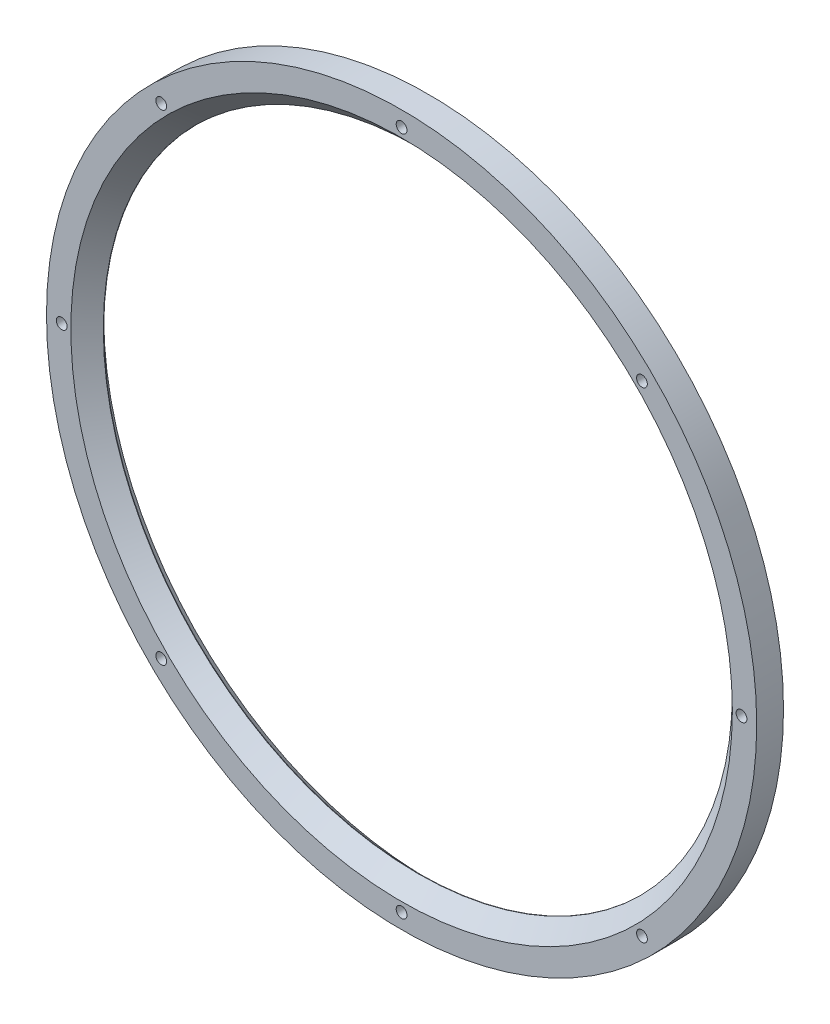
ISO-10303-21;
HEADER;
FILE_DESCRIPTION(('STEP AP214'),'2;1');
FILE_NAME('part.step','',(''),(''),'','','');
FILE_SCHEMA(('AUTOMOTIVE_DESIGN { 1 0 10303 214 1 1 1 1 }'));
ENDSEC;
DATA;
#1=APPLICATION_CONTEXT('core data for automotive mechanical design processes');
#2=APPLICATION_PROTOCOL_DEFINITION('international standard','automotive_design',2000,#1);
#3=PRODUCT_CONTEXT('',#1,'mechanical');
#4=PRODUCT('Part','Part','',(#3));
#5=PRODUCT_RELATED_PRODUCT_CATEGORY('part','',(#4));
#6=PRODUCT_DEFINITION_FORMATION('','',#4);
#7=PRODUCT_DEFINITION_CONTEXT('part definition',#1,'design');
#8=PRODUCT_DEFINITION('design','',#6,#7);
#9=PRODUCT_DEFINITION_SHAPE('','',#8);
#10=(LENGTH_UNIT() NAMED_UNIT(*) SI_UNIT(.MILLI.,.METRE.));
#11=(NAMED_UNIT(*) PLANE_ANGLE_UNIT() SI_UNIT($,.RADIAN.));
#12=(NAMED_UNIT(*) SI_UNIT($,.STERADIAN.) SOLID_ANGLE_UNIT());
#13=UNCERTAINTY_MEASURE_WITH_UNIT(LENGTH_MEASURE(1.E-05),#10,'distance_accuracy_value','');
#14=(GEOMETRIC_REPRESENTATION_CONTEXT(3) GLOBAL_UNCERTAINTY_ASSIGNED_CONTEXT((#13)) GLOBAL_UNIT_ASSIGNED_CONTEXT((#10,
#11,#12)) REPRESENTATION_CONTEXT('',''));
#15=CARTESIAN_POINT('',(0.,0.,0.));
#16=DIRECTION('',(0.,0.,1.));
#17=DIRECTION('',(1.,0.,0.));
#18=AXIS2_PLACEMENT_3D('',#15,#16,#17);
#19=CARTESIAN_POINT('',(0.,0.,-10.1600000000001));
#20=DIRECTION('',(0.,0.,1.));
#21=DIRECTION('',(1.,0.,0.));
#22=AXIS2_PLACEMENT_3D('',#19,#20,#21);
#23=CONICAL_SURFACE('',#22,196.85,0.785398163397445);
#24=CARTESIAN_POINT('',(0.,0.,0.));
#25=DIRECTION('',(0.,0.,1.));
#26=DIRECTION('',(1.,0.,0.));
#27=AXIS2_PLACEMENT_3D('',#24,#25,#26);
#28=CIRCLE('',#27,207.01);
#29=CARTESIAN_POINT('',(207.01,0.,0.));
#30=VERTEX_POINT('',#29);
#31=EDGE_CURVE('E53',#30,#30,#28,.T.);
#32=ORIENTED_EDGE('',*,*,#31,.T.);
#33=EDGE_LOOP('',(#32));
#34=FACE_BOUND('',#33,.T.);
#35=CARTESIAN_POINT('',(0.,0.,-10.1600000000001));
#36=DIRECTION('',(0.,0.,1.));
#37=DIRECTION('',(1.,0.,0.));
#38=AXIS2_PLACEMENT_3D('',#35,#36,#37);
#39=CIRCLE('',#38,196.85);
#40=CARTESIAN_POINT('',(196.85,0.,-10.1600000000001));
#41=VERTEX_POINT('',#40);
#42=EDGE_CURVE('E10',#41,#41,#39,.T.);
#43=ORIENTED_EDGE('',*,*,#42,.F.);
#44=EDGE_LOOP('',(#43));
#45=FACE_BOUND('',#44,.T.);
#46=ADVANCED_FACE('F31',(#34,#45),#23,.F.);
#47=CARTESIAN_POINT('',(0.,0.,0.));
#48=DIRECTION('',(0.,0.,1.));
#49=DIRECTION('',(1.,0.,0.));
#50=AXIS2_PLACEMENT_3D('',#47,#48,#49);
#51=CYLINDRICAL_SURFACE('',#50,196.85);
#52=ORIENTED_EDGE('',*,*,#42,.T.);
#53=EDGE_LOOP('',(#52));
#54=FACE_BOUND('',#53,.T.);
#55=CARTESIAN_POINT('',(0.,0.,-10.4139999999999));
#56=DIRECTION('',(0.,0.,1.));
#57=DIRECTION('',(1.,0.,0.));
#58=AXIS2_PLACEMENT_3D('',#55,#56,#57);
#59=CIRCLE('',#58,196.85);
#60=CARTESIAN_POINT('',(196.85,0.,-10.4139999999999));
#61=VERTEX_POINT('',#60);
#62=EDGE_CURVE('E37',#61,#61,#59,.T.);
#63=ORIENTED_EDGE('',*,*,#62,.F.);
#64=EDGE_LOOP('',(#63));
#65=FACE_BOUND('',#64,.T.);
#66=ADVANCED_FACE('F170',(#54,#65),#51,.F.);
#67=CARTESIAN_POINT('',(0.,0.,-16.764));
#68=DIRECTION('',(0.,0.,-1.));
#69=DIRECTION('',(-1.,0.,0.));
#70=AXIS2_PLACEMENT_3D('',#67,#68,#69);
#71=CONICAL_SURFACE('',#70,203.2,0.78539816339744);
#72=ORIENTED_EDGE('',*,*,#62,.T.);
#73=EDGE_LOOP('',(#72));
#74=FACE_BOUND('',#73,.T.);
#75=CARTESIAN_POINT('',(0.,0.,-16.764));
#76=DIRECTION('',(0.,0.,1.));
#77=DIRECTION('',(1.,0.,0.));
#78=AXIS2_PLACEMENT_3D('',#75,#76,#77);
#79=CIRCLE('',#78,203.2);
#80=CARTESIAN_POINT('',(203.2,0.,-16.764));
#81=VERTEX_POINT('',#80);
#82=EDGE_CURVE('E41',#81,#81,#79,.T.);
#83=ORIENTED_EDGE('',*,*,#82,.F.);
#84=EDGE_LOOP('',(#83));
#85=FACE_BOUND('',#84,.T.);
#86=ADVANCED_FACE('F135',(#74,#85),#71,.F.);
#87=CARTESIAN_POINT('',(222.25,0.,-16.764));
#88=DIRECTION('',(0.,0.,-1.));
#89=DIRECTION('',(-1.,0.,0.));
#90=AXIS2_PLACEMENT_3D('',#87,#88,#89);
#91=PLANE('',#90);
#92=CARTESIAN_POINT('',(150.419290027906,150.41929002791,-16.764));
#93=DIRECTION('',(0.,0.,-1.));
#94=DIRECTION('',(-1.,0.,0.));
#95=AXIS2_PLACEMENT_3D('',#92,#93,#94);
#96=CIRCLE('',#95,6.4389);
#97=CARTESIAN_POINT('',(143.980390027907,150.41929002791,-16.764));
#98=VERTEX_POINT('',#97);
#99=EDGE_CURVE('E125',#98,#98,#96,.T.);
#100=ORIENTED_EDGE('',*,*,#99,.F.);
#101=EDGE_LOOP('',(#100));
#102=FACE_BOUND('',#101,.T.);
#103=CARTESIAN_POINT('',(212.725,2.22817610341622E-12,-16.764));
#104=DIRECTION('',(0.,0.,-1.));
#105=DIRECTION('',(-1.,0.,0.));
#106=AXIS2_PLACEMENT_3D('',#103,#104,#105);
#107=CIRCLE('',#106,6.4389);
#108=CARTESIAN_POINT('',(206.2861,2.22817610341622E-12,-16.764));
#109=VERTEX_POINT('',#108);
#110=EDGE_CURVE('E116',#109,#109,#107,.T.);
#111=ORIENTED_EDGE('',*,*,#110,.F.);
#112=EDGE_LOOP('',(#111));
#113=FACE_BOUND('',#112,.T.);
#114=CARTESIAN_POINT('',(150.41929002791,-150.419290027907,-16.764));
#115=DIRECTION('',(0.,0.,-1.));
#116=DIRECTION('',(-1.,0.,0.));
#117=AXIS2_PLACEMENT_3D('',#114,#115,#116);
#118=CIRCLE('',#117,6.4389);
#119=CARTESIAN_POINT('',(143.98039002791,-150.419290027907,-16.764));
#120=VERTEX_POINT('',#119);
#121=EDGE_CURVE('E107',#120,#120,#118,.T.);
#122=ORIENTED_EDGE('',*,*,#121,.F.);
#123=EDGE_LOOP('',(#122));
#124=FACE_BOUND('',#123,.T.);
#125=CARTESIAN_POINT('',(0.,-212.725,-16.764));
#126=DIRECTION('',(0.,0.,-1.));
#127=DIRECTION('',(-1.,0.,0.));
#128=AXIS2_PLACEMENT_3D('',#125,#126,#127);
#129=CIRCLE('',#128,6.4389);
#130=CARTESIAN_POINT('',(-6.4389,-212.725,-16.764));
#131=VERTEX_POINT('',#130);
#132=EDGE_CURVE('E98',#131,#131,#129,.T.);
#133=ORIENTED_EDGE('',*,*,#132,.F.);
#134=EDGE_LOOP('',(#133));
#135=FACE_BOUND('',#134,.T.);
#136=CARTESIAN_POINT('',(-150.419290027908,-150.419290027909,-16.764));
#137=DIRECTION('',(0.,0.,-1.));
#138=DIRECTION('',(-1.,0.,0.));
#139=AXIS2_PLACEMENT_3D('',#136,#137,#138);
#140=CIRCLE('',#139,6.4389);
#141=CARTESIAN_POINT('',(-156.858190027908,-150.419290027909,-16.764));
#142=VERTEX_POINT('',#141);
#143=EDGE_CURVE('E89',#142,#142,#140,.T.);
#144=ORIENTED_EDGE('',*,*,#143,.F.);
#145=EDGE_LOOP('',(#144));
#146=FACE_BOUND('',#145,.T.);
#147=CARTESIAN_POINT('',(-212.725,-7.42725367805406E-13,-16.764));
#148=DIRECTION('',(0.,0.,-1.));
#149=DIRECTION('',(-1.,0.,0.));
#150=AXIS2_PLACEMENT_3D('',#147,#148,#149);
#151=CIRCLE('',#150,6.4389);
#152=CARTESIAN_POINT('',(-219.1639,-7.42725367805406E-13,-16.764));
#153=VERTEX_POINT('',#152);
#154=EDGE_CURVE('E80',#153,#153,#151,.T.);
#155=ORIENTED_EDGE('',*,*,#154,.F.);
#156=EDGE_LOOP('',(#155));
#157=FACE_BOUND('',#156,.T.);
#158=CARTESIAN_POINT('',(-150.419290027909,150.419290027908,-16.764));
#159=DIRECTION('',(0.,0.,-1.));
#160=DIRECTION('',(-1.,0.,0.));
#161=AXIS2_PLACEMENT_3D('',#158,#159,#160);
#162=CIRCLE('',#161,6.4389);
#163=CARTESIAN_POINT('',(-156.858190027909,150.419290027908,-16.764));
#164=VERTEX_POINT('',#163);
#165=EDGE_CURVE('E71',#164,#164,#162,.T.);
#166=ORIENTED_EDGE('',*,*,#165,.F.);
#167=EDGE_LOOP('',(#166));
#168=FACE_BOUND('',#167,.T.);
#169=CARTESIAN_POINT('',(0.,212.725,-16.764));
#170=DIRECTION('',(0.,0.,-1.));
#171=DIRECTION('',(-1.,0.,0.));
#172=AXIS2_PLACEMENT_3D('',#169,#170,#171);
#173=CIRCLE('',#172,6.4389);
#174=CARTESIAN_POINT('',(-6.4389,212.725,-16.764));
#175=VERTEX_POINT('',#174);
#176=EDGE_CURVE('E62',#175,#175,#173,.T.);
#177=ORIENTED_EDGE('',*,*,#176,.F.);
#178=EDGE_LOOP('',(#177));
#179=FACE_BOUND('',#178,.T.);
#180=ORIENTED_EDGE('',*,*,#82,.T.);
#181=EDGE_LOOP('',(#180));
#182=FACE_BOUND('',#181,.T.);
#183=CARTESIAN_POINT('',(0.,0.,-16.764));
#184=DIRECTION('',(0.,0.,1.));
#185=DIRECTION('',(1.,0.,0.));
#186=AXIS2_PLACEMENT_3D('',#183,#184,#185);
#187=CIRCLE('',#186,222.25);
#188=CARTESIAN_POINT('',(222.25,0.,-16.764));
#189=VERTEX_POINT('',#188);
#190=EDGE_CURVE('E45',#189,#189,#187,.T.);
#191=ORIENTED_EDGE('',*,*,#190,.F.);
#192=EDGE_LOOP('',(#191));
#193=FACE_BOUND('',#192,.T.);
#194=ADVANCED_FACE('F131',(#102,#113,#124,#135,#146,#157,#168,#179,#182,#193),#91,.T.);
#195=CARTESIAN_POINT('',(0.,0.,0.));
#196=DIRECTION('',(0.,0.,1.));
#197=DIRECTION('',(1.,0.,0.));
#198=AXIS2_PLACEMENT_3D('',#195,#196,#197);
#199=CYLINDRICAL_SURFACE('',#198,222.25);
#200=ORIENTED_EDGE('',*,*,#190,.T.);
#201=EDGE_LOOP('',(#200));
#202=FACE_BOUND('',#201,.T.);
#203=CARTESIAN_POINT('',(0.,0.,0.));
#204=DIRECTION('',(0.,0.,1.));
#205=DIRECTION('',(1.,0.,0.));
#206=AXIS2_PLACEMENT_3D('',#203,#204,#205);
#207=CIRCLE('',#206,222.25);
#208=CARTESIAN_POINT('',(222.25,0.,0.));
#209=VERTEX_POINT('',#208);
#210=EDGE_CURVE('E50',#209,#209,#207,.T.);
#211=ORIENTED_EDGE('',*,*,#210,.F.);
#212=EDGE_LOOP('',(#211));
#213=FACE_BOUND('',#212,.T.);
#214=ADVANCED_FACE('F134',(#202,#213),#199,.T.);
#215=CARTESIAN_POINT('',(207.01,0.,0.));
#216=DIRECTION('',(0.,0.,1.));
#217=DIRECTION('',(1.,0.,0.));
#218=AXIS2_PLACEMENT_3D('',#215,#216,#217);
#219=PLANE('',#218);
#220=CARTESIAN_POINT('',(150.419290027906,150.41929002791,0.));
#221=DIRECTION('',(0.,0.,-1.));
#222=DIRECTION('',(-1.,0.,0.));
#223=AXIS2_PLACEMENT_3D('',#220,#221,#222);
#224=CIRCLE('',#223,3.3782);
#225=CARTESIAN_POINT('',(147.041090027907,150.41929002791,0.));
#226=VERTEX_POINT('',#225);
#227=EDGE_CURVE('E119',#226,#226,#224,.T.);
#228=ORIENTED_EDGE('',*,*,#227,.T.);
#229=EDGE_LOOP('',(#228));
#230=FACE_BOUND('',#229,.T.);
#231=CARTESIAN_POINT('',(212.725,2.22817610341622E-12,0.));
#232=DIRECTION('',(0.,0.,-1.));
#233=DIRECTION('',(-1.,0.,0.));
#234=AXIS2_PLACEMENT_3D('',#231,#232,#233);
#235=CIRCLE('',#234,3.3782);
#236=CARTESIAN_POINT('',(209.3468,2.22817610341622E-12,0.));
#237=VERTEX_POINT('',#236);
#238=EDGE_CURVE('E110',#237,#237,#235,.T.);
#239=ORIENTED_EDGE('',*,*,#238,.T.);
#240=EDGE_LOOP('',(#239));
#241=FACE_BOUND('',#240,.T.);
#242=CARTESIAN_POINT('',(150.41929002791,-150.419290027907,0.));
#243=DIRECTION('',(0.,0.,-1.));
#244=DIRECTION('',(-1.,0.,0.));
#245=AXIS2_PLACEMENT_3D('',#242,#243,#244);
#246=CIRCLE('',#245,3.3782);
#247=CARTESIAN_POINT('',(147.04109002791,-150.419290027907,0.));
#248=VERTEX_POINT('',#247);
#249=EDGE_CURVE('E101',#248,#248,#246,.T.);
#250=ORIENTED_EDGE('',*,*,#249,.T.);
#251=EDGE_LOOP('',(#250));
#252=FACE_BOUND('',#251,.T.);
#253=CARTESIAN_POINT('',(0.,-212.725,0.));
#254=DIRECTION('',(0.,0.,-1.));
#255=DIRECTION('',(-1.,0.,0.));
#256=AXIS2_PLACEMENT_3D('',#253,#254,#255);
#257=CIRCLE('',#256,3.3782);
#258=CARTESIAN_POINT('',(-3.3782,-212.725,0.));
#259=VERTEX_POINT('',#258);
#260=EDGE_CURVE('E92',#259,#259,#257,.T.);
#261=ORIENTED_EDGE('',*,*,#260,.T.);
#262=EDGE_LOOP('',(#261));
#263=FACE_BOUND('',#262,.T.);
#264=CARTESIAN_POINT('',(-150.419290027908,-150.419290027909,0.));
#265=DIRECTION('',(0.,0.,-1.));
#266=DIRECTION('',(-1.,0.,0.));
#267=AXIS2_PLACEMENT_3D('',#264,#265,#266);
#268=CIRCLE('',#267,3.3782);
#269=CARTESIAN_POINT('',(-153.797490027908,-150.419290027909,0.));
#270=VERTEX_POINT('',#269);
#271=EDGE_CURVE('E83',#270,#270,#268,.T.);
#272=ORIENTED_EDGE('',*,*,#271,.T.);
#273=EDGE_LOOP('',(#272));
#274=FACE_BOUND('',#273,.T.);
#275=CARTESIAN_POINT('',(-212.725,-7.42725367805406E-13,0.));
#276=DIRECTION('',(0.,0.,-1.));
#277=DIRECTION('',(-1.,0.,0.));
#278=AXIS2_PLACEMENT_3D('',#275,#276,#277);
#279=CIRCLE('',#278,3.3782);
#280=CARTESIAN_POINT('',(-216.1032,-7.42725367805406E-13,0.));
#281=VERTEX_POINT('',#280);
#282=EDGE_CURVE('E74',#281,#281,#279,.T.);
#283=ORIENTED_EDGE('',*,*,#282,.T.);
#284=EDGE_LOOP('',(#283));
#285=FACE_BOUND('',#284,.T.);
#286=CARTESIAN_POINT('',(-150.419290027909,150.419290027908,0.));
#287=DIRECTION('',(0.,0.,-1.));
#288=DIRECTION('',(-1.,0.,0.));
#289=AXIS2_PLACEMENT_3D('',#286,#287,#288);
#290=CIRCLE('',#289,3.3782);
#291=CARTESIAN_POINT('',(-153.797490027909,150.419290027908,0.));
#292=VERTEX_POINT('',#291);
#293=EDGE_CURVE('E65',#292,#292,#290,.T.);
#294=ORIENTED_EDGE('',*,*,#293,.T.);
#295=EDGE_LOOP('',(#294));
#296=FACE_BOUND('',#295,.T.);
#297=CARTESIAN_POINT('',(0.,212.725,0.));
#298=DIRECTION('',(0.,0.,-1.));
#299=DIRECTION('',(-1.,0.,0.));
#300=AXIS2_PLACEMENT_3D('',#297,#298,#299);
#301=CIRCLE('',#300,3.3782);
#302=CARTESIAN_POINT('',(-3.3782,212.725,0.));
#303=VERTEX_POINT('',#302);
#304=EDGE_CURVE('E56',#303,#303,#301,.T.);
#305=ORIENTED_EDGE('',*,*,#304,.T.);
#306=EDGE_LOOP('',(#305));
#307=FACE_BOUND('',#306,.T.);
#308=ORIENTED_EDGE('',*,*,#210,.T.);
#309=EDGE_LOOP('',(#308));
#310=FACE_BOUND('',#309,.T.);
#311=ORIENTED_EDGE('',*,*,#31,.F.);
#312=EDGE_LOOP('',(#311));
#313=FACE_BOUND('',#312,.T.);
#314=ADVANCED_FACE('F157',(#230,#241,#252,#263,#274,#285,#296,#307,#310,#313),#219,.T.);
#315=CARTESIAN_POINT('',(0.,212.725,-16.764));
#316=DIRECTION('',(0.,0.,-1.));
#317=DIRECTION('',(-1.,0.,0.));
#318=AXIS2_PLACEMENT_3D('',#315,#316,#317);
#319=CYLINDRICAL_SURFACE('',#318,3.3782);
#320=ORIENTED_EDGE('',*,*,#304,.F.);
#321=EDGE_LOOP('',(#320));
#322=FACE_BOUND('',#321,.T.);
#323=CARTESIAN_POINT('',(0.,212.725,-14.1957677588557));
#324=DIRECTION('',(0.,0.,-1.));
#325=DIRECTION('',(-1.,0.,0.));
#326=AXIS2_PLACEMENT_3D('',#323,#324,#325);
#327=CIRCLE('',#326,3.3782);
#328=CARTESIAN_POINT('',(-3.3782,212.725,-14.1957677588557));
#329=VERTEX_POINT('',#328);
#330=EDGE_CURVE('E59',#329,#329,#327,.T.);
#331=ORIENTED_EDGE('',*,*,#330,.T.);
#332=EDGE_LOOP('',(#331));
#333=FACE_BOUND('',#332,.T.);
#334=ADVANCED_FACE('F163',(#322,#333),#319,.F.);
#335=CARTESIAN_POINT('',(0.,212.725,-16.764));
#336=DIRECTION('',(0.,0.,-1.));
#337=DIRECTION('',(-1.,0.,0.));
#338=AXIS2_PLACEMENT_3D('',#335,#336,#337);
#339=CONICAL_SURFACE('',#338,6.4389,0.872664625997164);
#340=ORIENTED_EDGE('',*,*,#330,.F.);
#341=EDGE_LOOP('',(#340));
#342=FACE_BOUND('',#341,.T.);
#343=ORIENTED_EDGE('',*,*,#176,.T.);
#344=EDGE_LOOP('',(#343));
#345=FACE_BOUND('',#344,.T.);
#346=ADVANCED_FACE('F182',(#342,#345),#339,.F.);
#347=CARTESIAN_POINT('',(-150.419290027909,150.419290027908,-16.764));
#348=DIRECTION('',(0.,0.,-1.));
#349=DIRECTION('',(-1.,0.,0.));
#350=AXIS2_PLACEMENT_3D('',#347,#348,#349);
#351=CYLINDRICAL_SURFACE('',#350,3.3782);
#352=ORIENTED_EDGE('',*,*,#293,.F.);
#353=EDGE_LOOP('',(#352));
#354=FACE_BOUND('',#353,.T.);
#355=CARTESIAN_POINT('',(-150.419290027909,150.419290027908,-14.1957677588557));
#356=DIRECTION('',(0.,0.,-1.));
#357=DIRECTION('',(-1.,0.,0.));
#358=AXIS2_PLACEMENT_3D('',#355,#356,#357);
#359=CIRCLE('',#358,3.3782);
#360=CARTESIAN_POINT('',(-153.797490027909,150.419290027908,-14.1957677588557));
#361=VERTEX_POINT('',#360);
#362=EDGE_CURVE('E68',#361,#361,#359,.T.);
#363=ORIENTED_EDGE('',*,*,#362,.T.);
#364=EDGE_LOOP('',(#363));
#365=FACE_BOUND('',#364,.T.);
#366=ADVANCED_FACE('F186',(#354,#365),#351,.F.);
#367=CARTESIAN_POINT('',(-150.419290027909,150.419290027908,-16.764));
#368=DIRECTION('',(0.,0.,-1.));
#369=DIRECTION('',(-1.,0.,0.));
#370=AXIS2_PLACEMENT_3D('',#367,#368,#369);
#371=CONICAL_SURFACE('',#370,6.4389,0.872664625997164);
#372=ORIENTED_EDGE('',*,*,#362,.F.);
#373=EDGE_LOOP('',(#372));
#374=FACE_BOUND('',#373,.T.);
#375=ORIENTED_EDGE('',*,*,#165,.T.);
#376=EDGE_LOOP('',(#375));
#377=FACE_BOUND('',#376,.T.);
#378=ADVANCED_FACE('F190',(#374,#377),#371,.F.);
#379=CARTESIAN_POINT('',(-212.725,-7.42725367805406E-13,-16.764));
#380=DIRECTION('',(0.,0.,-1.));
#381=DIRECTION('',(-1.,0.,0.));
#382=AXIS2_PLACEMENT_3D('',#379,#380,#381);
#383=CYLINDRICAL_SURFACE('',#382,3.3782);
#384=ORIENTED_EDGE('',*,*,#282,.F.);
#385=EDGE_LOOP('',(#384));
#386=FACE_BOUND('',#385,.T.);
#387=CARTESIAN_POINT('',(-212.725,-7.42725367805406E-13,-14.1957677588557));
#388=DIRECTION('',(0.,0.,-1.));
#389=DIRECTION('',(-1.,0.,0.));
#390=AXIS2_PLACEMENT_3D('',#387,#388,#389);
#391=CIRCLE('',#390,3.3782);
#392=CARTESIAN_POINT('',(-216.1032,-7.42725367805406E-13,-14.1957677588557));
#393=VERTEX_POINT('',#392);
#394=EDGE_CURVE('E77',#393,#393,#391,.T.);
#395=ORIENTED_EDGE('',*,*,#394,.T.);
#396=EDGE_LOOP('',(#395));
#397=FACE_BOUND('',#396,.T.);
#398=ADVANCED_FACE('F194',(#386,#397),#383,.F.);
#399=CARTESIAN_POINT('',(-212.725,-7.42725367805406E-13,-16.764));
#400=DIRECTION('',(0.,0.,-1.));
#401=DIRECTION('',(-1.,0.,0.));
#402=AXIS2_PLACEMENT_3D('',#399,#400,#401);
#403=CONICAL_SURFACE('',#402,6.4389,0.872664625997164);
#404=ORIENTED_EDGE('',*,*,#394,.F.);
#405=EDGE_LOOP('',(#404));
#406=FACE_BOUND('',#405,.T.);
#407=ORIENTED_EDGE('',*,*,#154,.T.);
#408=EDGE_LOOP('',(#407));
#409=FACE_BOUND('',#408,.T.);
#410=ADVANCED_FACE('F198',(#406,#409),#403,.F.);
#411=CARTESIAN_POINT('',(-150.419290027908,-150.419290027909,-16.764));
#412=DIRECTION('',(0.,0.,-1.));
#413=DIRECTION('',(-1.,0.,0.));
#414=AXIS2_PLACEMENT_3D('',#411,#412,#413);
#415=CYLINDRICAL_SURFACE('',#414,3.3782);
#416=ORIENTED_EDGE('',*,*,#271,.F.);
#417=EDGE_LOOP('',(#416));
#418=FACE_BOUND('',#417,.T.);
#419=CARTESIAN_POINT('',(-150.419290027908,-150.419290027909,-14.1957677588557));
#420=DIRECTION('',(0.,0.,-1.));
#421=DIRECTION('',(-1.,0.,0.));
#422=AXIS2_PLACEMENT_3D('',#419,#420,#421);
#423=CIRCLE('',#422,3.3782);
#424=CARTESIAN_POINT('',(-153.797490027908,-150.419290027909,-14.1957677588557));
#425=VERTEX_POINT('',#424);
#426=EDGE_CURVE('E86',#425,#425,#423,.T.);
#427=ORIENTED_EDGE('',*,*,#426,.T.);
#428=EDGE_LOOP('',(#427));
#429=FACE_BOUND('',#428,.T.);
#430=ADVANCED_FACE('F202',(#418,#429),#415,.F.);
#431=CARTESIAN_POINT('',(-150.419290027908,-150.419290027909,-16.764));
#432=DIRECTION('',(0.,0.,-1.));
#433=DIRECTION('',(-1.,0.,0.));
#434=AXIS2_PLACEMENT_3D('',#431,#432,#433);
#435=CONICAL_SURFACE('',#434,6.4389,0.872664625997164);
#436=ORIENTED_EDGE('',*,*,#426,.F.);
#437=EDGE_LOOP('',(#436));
#438=FACE_BOUND('',#437,.T.);
#439=ORIENTED_EDGE('',*,*,#143,.T.);
#440=EDGE_LOOP('',(#439));
#441=FACE_BOUND('',#440,.T.);
#442=ADVANCED_FACE('F206',(#438,#441),#435,.F.);
#443=CARTESIAN_POINT('',(0.,-212.725,-16.764));
#444=DIRECTION('',(0.,0.,-1.));
#445=DIRECTION('',(-1.,0.,0.));
#446=AXIS2_PLACEMENT_3D('',#443,#444,#445);
#447=CYLINDRICAL_SURFACE('',#446,3.3782);
#448=ORIENTED_EDGE('',*,*,#260,.F.);
#449=EDGE_LOOP('',(#448));
#450=FACE_BOUND('',#449,.T.);
#451=CARTESIAN_POINT('',(0.,-212.725,-14.1957677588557));
#452=DIRECTION('',(0.,0.,-1.));
#453=DIRECTION('',(-1.,0.,0.));
#454=AXIS2_PLACEMENT_3D('',#451,#452,#453);
#455=CIRCLE('',#454,3.3782);
#456=CARTESIAN_POINT('',(-3.3782,-212.725,-14.1957677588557));
#457=VERTEX_POINT('',#456);
#458=EDGE_CURVE('E95',#457,#457,#455,.T.);
#459=ORIENTED_EDGE('',*,*,#458,.T.);
#460=EDGE_LOOP('',(#459));
#461=FACE_BOUND('',#460,.T.);
#462=ADVANCED_FACE('F210',(#450,#461),#447,.F.);
#463=CARTESIAN_POINT('',(0.,-212.725,-16.764));
#464=DIRECTION('',(0.,0.,-1.));
#465=DIRECTION('',(-1.,0.,0.));
#466=AXIS2_PLACEMENT_3D('',#463,#464,#465);
#467=CONICAL_SURFACE('',#466,6.4389,0.872664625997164);
#468=ORIENTED_EDGE('',*,*,#458,.F.);
#469=EDGE_LOOP('',(#468));
#470=FACE_BOUND('',#469,.T.);
#471=ORIENTED_EDGE('',*,*,#132,.T.);
#472=EDGE_LOOP('',(#471));
#473=FACE_BOUND('',#472,.T.);
#474=ADVANCED_FACE('F214',(#470,#473),#467,.F.);
#475=CARTESIAN_POINT('',(150.41929002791,-150.419290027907,-16.764));
#476=DIRECTION('',(0.,0.,-1.));
#477=DIRECTION('',(-1.,0.,0.));
#478=AXIS2_PLACEMENT_3D('',#475,#476,#477);
#479=CYLINDRICAL_SURFACE('',#478,3.3782);
#480=ORIENTED_EDGE('',*,*,#249,.F.);
#481=EDGE_LOOP('',(#480));
#482=FACE_BOUND('',#481,.T.);
#483=CARTESIAN_POINT('',(150.41929002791,-150.419290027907,-14.1957677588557));
#484=DIRECTION('',(0.,0.,-1.));
#485=DIRECTION('',(-1.,0.,0.));
#486=AXIS2_PLACEMENT_3D('',#483,#484,#485);
#487=CIRCLE('',#486,3.3782);
#488=CARTESIAN_POINT('',(147.04109002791,-150.419290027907,-14.1957677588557));
#489=VERTEX_POINT('',#488);
#490=EDGE_CURVE('E104',#489,#489,#487,.T.);
#491=ORIENTED_EDGE('',*,*,#490,.T.);
#492=EDGE_LOOP('',(#491));
#493=FACE_BOUND('',#492,.T.);
#494=ADVANCED_FACE('F218',(#482,#493),#479,.F.);
#495=CARTESIAN_POINT('',(150.41929002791,-150.419290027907,-16.764));
#496=DIRECTION('',(0.,0.,-1.));
#497=DIRECTION('',(-1.,0.,0.));
#498=AXIS2_PLACEMENT_3D('',#495,#496,#497);
#499=CONICAL_SURFACE('',#498,6.4389,0.872664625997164);
#500=ORIENTED_EDGE('',*,*,#490,.F.);
#501=EDGE_LOOP('',(#500));
#502=FACE_BOUND('',#501,.T.);
#503=ORIENTED_EDGE('',*,*,#121,.T.);
#504=EDGE_LOOP('',(#503));
#505=FACE_BOUND('',#504,.T.);
#506=ADVANCED_FACE('F222',(#502,#505),#499,.F.);
#507=CARTESIAN_POINT('',(212.725,2.22817610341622E-12,-16.764));
#508=DIRECTION('',(0.,0.,-1.));
#509=DIRECTION('',(-1.,0.,0.));
#510=AXIS2_PLACEMENT_3D('',#507,#508,#509);
#511=CYLINDRICAL_SURFACE('',#510,3.3782);
#512=ORIENTED_EDGE('',*,*,#238,.F.);
#513=EDGE_LOOP('',(#512));
#514=FACE_BOUND('',#513,.T.);
#515=CARTESIAN_POINT('',(212.725,2.22817610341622E-12,-14.1957677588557));
#516=DIRECTION('',(0.,0.,-1.));
#517=DIRECTION('',(-1.,0.,0.));
#518=AXIS2_PLACEMENT_3D('',#515,#516,#517);
#519=CIRCLE('',#518,3.3782);
#520=CARTESIAN_POINT('',(209.3468,2.22817610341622E-12,-14.1957677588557));
#521=VERTEX_POINT('',#520);
#522=EDGE_CURVE('E113',#521,#521,#519,.T.);
#523=ORIENTED_EDGE('',*,*,#522,.T.);
#524=EDGE_LOOP('',(#523));
#525=FACE_BOUND('',#524,.T.);
#526=ADVANCED_FACE('F226',(#514,#525),#511,.F.);
#527=CARTESIAN_POINT('',(212.725,2.22817610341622E-12,-16.764));
#528=DIRECTION('',(0.,0.,-1.));
#529=DIRECTION('',(-1.,0.,0.));
#530=AXIS2_PLACEMENT_3D('',#527,#528,#529);
#531=CONICAL_SURFACE('',#530,6.4389,0.872664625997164);
#532=ORIENTED_EDGE('',*,*,#522,.F.);
#533=EDGE_LOOP('',(#532));
#534=FACE_BOUND('',#533,.T.);
#535=ORIENTED_EDGE('',*,*,#110,.T.);
#536=EDGE_LOOP('',(#535));
#537=FACE_BOUND('',#536,.T.);
#538=ADVANCED_FACE('F230',(#534,#537),#531,.F.);
#539=CARTESIAN_POINT('',(150.419290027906,150.41929002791,-16.764));
#540=DIRECTION('',(0.,0.,-1.));
#541=DIRECTION('',(-1.,0.,0.));
#542=AXIS2_PLACEMENT_3D('',#539,#540,#541);
#543=CYLINDRICAL_SURFACE('',#542,3.3782);
#544=ORIENTED_EDGE('',*,*,#227,.F.);
#545=EDGE_LOOP('',(#544));
#546=FACE_BOUND('',#545,.T.);
#547=CARTESIAN_POINT('',(150.419290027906,150.41929002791,-14.1957677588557));
#548=DIRECTION('',(0.,0.,-1.));
#549=DIRECTION('',(-1.,0.,0.));
#550=AXIS2_PLACEMENT_3D('',#547,#548,#549);
#551=CIRCLE('',#550,3.3782);
#552=CARTESIAN_POINT('',(147.041090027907,150.41929002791,-14.1957677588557));
#553=VERTEX_POINT('',#552);
#554=EDGE_CURVE('E122',#553,#553,#551,.T.);
#555=ORIENTED_EDGE('',*,*,#554,.T.);
#556=EDGE_LOOP('',(#555));
#557=FACE_BOUND('',#556,.T.);
#558=ADVANCED_FACE('F234',(#546,#557),#543,.F.);
#559=CARTESIAN_POINT('',(150.419290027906,150.41929002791,-16.764));
#560=DIRECTION('',(0.,0.,-1.));
#561=DIRECTION('',(-1.,0.,0.));
#562=AXIS2_PLACEMENT_3D('',#559,#560,#561);
#563=CONICAL_SURFACE('',#562,6.4389,0.872664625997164);
#564=ORIENTED_EDGE('',*,*,#554,.F.);
#565=EDGE_LOOP('',(#564));
#566=FACE_BOUND('',#565,.T.);
#567=ORIENTED_EDGE('',*,*,#99,.T.);
#568=EDGE_LOOP('',(#567));
#569=FACE_BOUND('',#568,.T.);
#570=ADVANCED_FACE('F129',(#566,#569),#563,.F.);
#571=CLOSED_SHELL('',(#46,#66,#86,#194,#214,#314,#334,#346,#366,#378,#398,#410,#430,#442,#462,
#474,#494,#506,#526,#538,#558,#570));
#572=MANIFOLD_SOLID_BREP('B2',#571);
#573=ADVANCED_BREP_SHAPE_REPRESENTATION('',(#18,#572),#14);
#574=SHAPE_DEFINITION_REPRESENTATION(#9,#573);
ENDSEC;
END-ISO-10303-21;
